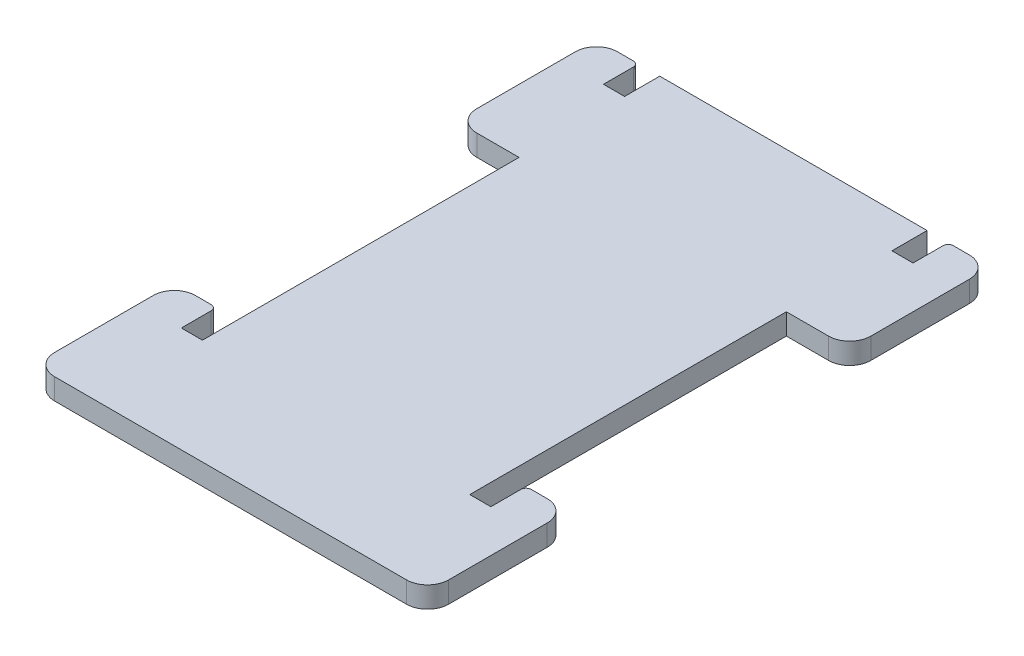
ISO-10303-21;
HEADER;
FILE_DESCRIPTION(('STEP AP214'),'2;1');
FILE_NAME('part.step','',(''),(''),'','','');
FILE_SCHEMA(('AUTOMOTIVE_DESIGN { 1 0 10303 214 1 1 1 1 }'));
ENDSEC;
DATA;
#1=APPLICATION_CONTEXT('core data for automotive mechanical design processes');
#2=APPLICATION_PROTOCOL_DEFINITION('international standard','automotive_design',2000,#1);
#3=PRODUCT_CONTEXT('',#1,'mechanical');
#4=PRODUCT('Part','Part','',(#3));
#5=PRODUCT_RELATED_PRODUCT_CATEGORY('part','',(#4));
#6=PRODUCT_DEFINITION_FORMATION('','',#4);
#7=PRODUCT_DEFINITION_CONTEXT('part definition',#1,'design');
#8=PRODUCT_DEFINITION('design','',#6,#7);
#9=PRODUCT_DEFINITION_SHAPE('','',#8);
#10=(LENGTH_UNIT() NAMED_UNIT(*) SI_UNIT(.MILLI.,.METRE.));
#11=(NAMED_UNIT(*) PLANE_ANGLE_UNIT() SI_UNIT($,.RADIAN.));
#12=(NAMED_UNIT(*) SI_UNIT($,.STERADIAN.) SOLID_ANGLE_UNIT());
#13=UNCERTAINTY_MEASURE_WITH_UNIT(LENGTH_MEASURE(1.E-05),#10,'distance_accuracy_value','');
#14=(GEOMETRIC_REPRESENTATION_CONTEXT(3) GLOBAL_UNCERTAINTY_ASSIGNED_CONTEXT((#13)) GLOBAL_UNIT_ASSIGNED_CONTEXT((#10,
#11,#12)) REPRESENTATION_CONTEXT('',''));
#15=CARTESIAN_POINT('',(0.,0.,0.));
#16=DIRECTION('',(0.,0.,1.));
#17=DIRECTION('',(1.,0.,0.));
#18=AXIS2_PLACEMENT_3D('',#15,#16,#17);
#19=CARTESIAN_POINT('',(47.,3.,0.));
#20=DIRECTION('',(-1.,0.,0.));
#21=DIRECTION('',(0.,0.,1.));
#22=AXIS2_PLACEMENT_3D('',#19,#20,#21);
#23=PLANE('',#22);
#24=DIRECTION('',(0.,0.,-1.));
#25=VECTOR('',#24,1.);
#26=CARTESIAN_POINT('',(47.,3.,0.));
#27=LINE('',#26,#25);
#28=CARTESIAN_POINT('',(47.,3.,-3.));
#29=VERTEX_POINT('',#28);
#30=CARTESIAN_POINT('',(47.,3.,-17.));
#31=VERTEX_POINT('',#30);
#32=EDGE_CURVE('E769',#29,#31,#27,.T.);
#33=ORIENTED_EDGE('',*,*,#32,.F.);
#34=DIRECTION('',(0.,-1.,0.));
#35=VECTOR('',#34,1.);
#36=CARTESIAN_POINT('',(47.,3.,-3.));
#37=LINE('',#36,#35);
#38=CARTESIAN_POINT('',(47.,0.,-3.));
#39=VERTEX_POINT('',#38);
#40=EDGE_CURVE('E636',#29,#39,#37,.T.);
#41=ORIENTED_EDGE('',*,*,#40,.T.);
#42=DIRECTION('',(0.,0.,-1.));
#43=VECTOR('',#42,1.);
#44=CARTESIAN_POINT('',(47.,0.,0.));
#45=LINE('',#44,#43);
#46=CARTESIAN_POINT('',(47.,0.,-17.));
#47=VERTEX_POINT('',#46);
#48=EDGE_CURVE('E366',#39,#47,#45,.T.);
#49=ORIENTED_EDGE('',*,*,#48,.T.);
#50=DIRECTION('',(0.,-1.,0.));
#51=VECTOR('',#50,1.);
#52=CARTESIAN_POINT('',(47.,3.,-17.));
#53=LINE('',#52,#51);
#54=EDGE_CURVE('E506',#47,#31,#53,.F.);
#55=ORIENTED_EDGE('',*,*,#54,.T.);
#56=EDGE_LOOP('',(#33,#41,#49,#55));
#57=FACE_BOUND('',#56,.T.);
#58=ADVANCED_FACE('F38',(#57),#23,.F.);
#59=CARTESIAN_POINT('',(41.,3.,-20.));
#60=DIRECTION('',(0.,0.,1.));
#61=DIRECTION('',(1.,0.,0.));
#62=AXIS2_PLACEMENT_3D('',#59,#60,#61);
#63=PLANE('',#62);
#64=DIRECTION('',(-1.,0.,0.));
#65=VECTOR('',#64,1.);
#66=CARTESIAN_POINT('',(41.,0.,-20.));
#67=LINE('',#66,#65);
#68=CARTESIAN_POINT('',(44.,0.,-20.));
#69=VERTEX_POINT('',#68);
#70=CARTESIAN_POINT('',(41.75,0.,-20.));
#71=VERTEX_POINT('',#70);
#72=EDGE_CURVE('E369',#69,#71,#67,.T.);
#73=ORIENTED_EDGE('',*,*,#72,.T.);
#74=DIRECTION('',(0.,-1.,0.));
#75=VECTOR('',#74,1.);
#76=CARTESIAN_POINT('',(41.75,3.,-20.));
#77=LINE('',#76,#75);
#78=CARTESIAN_POINT('',(41.75,3.,-20.));
#79=VERTEX_POINT('',#78);
#80=EDGE_CURVE('E593',#71,#79,#77,.F.);
#81=ORIENTED_EDGE('',*,*,#80,.T.);
#82=DIRECTION('',(-1.,0.,0.));
#83=VECTOR('',#82,1.);
#84=CARTESIAN_POINT('',(41.,3.,-20.));
#85=LINE('',#84,#83);
#86=CARTESIAN_POINT('',(44.,3.,-20.));
#87=VERTEX_POINT('',#86);
#88=EDGE_CURVE('E284',#87,#79,#85,.T.);
#89=ORIENTED_EDGE('',*,*,#88,.F.);
#90=DIRECTION('',(0.,-1.,0.));
#91=VECTOR('',#90,1.);
#92=CARTESIAN_POINT('',(44.,3.,-20.));
#93=LINE('',#92,#91);
#94=EDGE_CURVE('E294',#87,#69,#93,.T.);
#95=ORIENTED_EDGE('',*,*,#94,.T.);
#96=EDGE_LOOP('',(#73,#81,#89,#95));
#97=FACE_BOUND('',#96,.T.);
#98=ADVANCED_FACE('F793',(#97),#63,.F.);
#99=CARTESIAN_POINT('',(41.,3.,-15.));
#100=DIRECTION('',(1.,0.,0.));
#101=DIRECTION('',(0.,0.,-1.));
#102=AXIS2_PLACEMENT_3D('',#99,#100,#101);
#103=PLANE('',#102);
#104=DIRECTION('',(0.,0.,1.));
#105=VECTOR('',#104,1.);
#106=CARTESIAN_POINT('',(41.,3.,-15.));
#107=LINE('',#106,#105);
#108=CARTESIAN_POINT('',(41.,3.,-19.25));
#109=VERTEX_POINT('',#108);
#110=CARTESIAN_POINT('',(41.,3.,-15.));
#111=VERTEX_POINT('',#110);
#112=EDGE_CURVE('E270',#109,#111,#107,.T.);
#113=ORIENTED_EDGE('',*,*,#112,.F.);
#114=DIRECTION('',(0.,-1.,0.));
#115=VECTOR('',#114,1.);
#116=CARTESIAN_POINT('',(41.,3.,-19.25));
#117=LINE('',#116,#115);
#118=CARTESIAN_POINT('',(41.,0.,-19.25));
#119=VERTEX_POINT('',#118);
#120=EDGE_CURVE('E590',#109,#119,#117,.T.);
#121=ORIENTED_EDGE('',*,*,#120,.T.);
#122=DIRECTION('',(0.,0.,1.));
#123=VECTOR('',#122,1.);
#124=CARTESIAN_POINT('',(41.,0.,-15.));
#125=LINE('',#124,#123);
#126=CARTESIAN_POINT('',(41.,0.,-15.));
#127=VERTEX_POINT('',#126);
#128=EDGE_CURVE('E290',#119,#127,#125,.T.);
#129=ORIENTED_EDGE('',*,*,#128,.T.);
#130=DIRECTION('',(0.,-1.,0.));
#131=VECTOR('',#130,1.);
#132=CARTESIAN_POINT('',(41.,3.,-15.));
#133=LINE('',#132,#131);
#134=EDGE_CURVE('E287',#111,#127,#133,.T.);
#135=ORIENTED_EDGE('',*,*,#134,.F.);
#136=EDGE_LOOP('',(#113,#121,#129,#135));
#137=FACE_BOUND('',#136,.T.);
#138=ADVANCED_FACE('F288',(#137),#103,.F.);
#139=CARTESIAN_POINT('',(38.,3.,-15.));
#140=DIRECTION('',(0.,0.,1.));
#141=DIRECTION('',(1.,0.,0.));
#142=AXIS2_PLACEMENT_3D('',#139,#140,#141);
#143=PLANE('',#142);
#144=DIRECTION('',(-1.,0.,0.));
#145=VECTOR('',#144,1.);
#146=CARTESIAN_POINT('',(38.,0.,-15.));
#147=LINE('',#146,#145);
#148=CARTESIAN_POINT('',(38.,0.,-15.));
#149=VERTEX_POINT('',#148);
#150=EDGE_CURVE('E375',#127,#149,#147,.T.);
#151=ORIENTED_EDGE('',*,*,#150,.T.);
#152=DIRECTION('',(0.,-1.,0.));
#153=VECTOR('',#152,1.);
#154=CARTESIAN_POINT('',(38.,3.,-15.));
#155=LINE('',#154,#153);
#156=CARTESIAN_POINT('',(38.,3.,-15.));
#157=VERTEX_POINT('',#156);
#158=EDGE_CURVE('E295',#157,#149,#155,.T.);
#159=ORIENTED_EDGE('',*,*,#158,.F.);
#160=DIRECTION('',(-1.,0.,0.));
#161=VECTOR('',#160,1.);
#162=CARTESIAN_POINT('',(38.,3.,-15.));
#163=LINE('',#162,#161);
#164=EDGE_CURVE('E275',#111,#157,#163,.T.);
#165=ORIENTED_EDGE('',*,*,#164,.F.);
#166=ORIENTED_EDGE('',*,*,#134,.T.);
#167=EDGE_LOOP('',(#151,#159,#165,#166));
#168=FACE_BOUND('',#167,.T.);
#169=ADVANCED_FACE('F297',(#168),#143,.F.);
#170=CARTESIAN_POINT('',(38.,3.,-15.));
#171=DIRECTION('',(-1.,0.,0.));
#172=DIRECTION('',(0.,0.,1.));
#173=AXIS2_PLACEMENT_3D('',#170,#171,#172);
#174=PLANE('',#173);
#175=DIRECTION('',(0.,0.,-1.));
#176=VECTOR('',#175,1.);
#177=CARTESIAN_POINT('',(38.,0.,-15.));
#178=LINE('',#177,#176);
#179=CARTESIAN_POINT('',(38.,0.,-60.));
#180=VERTEX_POINT('',#179);
#181=EDGE_CURVE('E378',#149,#180,#178,.T.);
#182=ORIENTED_EDGE('',*,*,#181,.T.);
#183=DIRECTION('',(0.,-1.,0.));
#184=VECTOR('',#183,1.);
#185=CARTESIAN_POINT('',(38.,3.,-60.));
#186=LINE('',#185,#184);
#187=CARTESIAN_POINT('',(38.,3.,-60.));
#188=VERTEX_POINT('',#187);
#189=EDGE_CURVE('E481',#188,#180,#186,.T.);
#190=ORIENTED_EDGE('',*,*,#189,.F.);
#191=DIRECTION('',(0.,0.,-1.));
#192=VECTOR('',#191,1.);
#193=CARTESIAN_POINT('',(38.,3.,-15.));
#194=LINE('',#193,#192);
#195=EDGE_CURVE('E301',#157,#188,#194,.T.);
#196=ORIENTED_EDGE('',*,*,#195,.F.);
#197=ORIENTED_EDGE('',*,*,#158,.T.);
#198=EDGE_LOOP('',(#182,#190,#196,#197));
#199=FACE_BOUND('',#198,.T.);
#200=ADVANCED_FACE('F784',(#199),#174,.F.);
#201=CARTESIAN_POINT('',(41.,3.,-60.));
#202=DIRECTION('',(0.,0.,-1.));
#203=DIRECTION('',(-1.,0.,0.));
#204=AXIS2_PLACEMENT_3D('',#201,#202,#203);
#205=PLANE('',#204);
#206=DIRECTION('',(1.,0.,0.));
#207=VECTOR('',#206,1.);
#208=CARTESIAN_POINT('',(41.,0.,-60.));
#209=LINE('',#208,#207);
#210=CARTESIAN_POINT('',(44.,0.,-60.));
#211=VERTEX_POINT('',#210);
#212=EDGE_CURVE('E382',#180,#211,#209,.T.);
#213=ORIENTED_EDGE('',*,*,#212,.T.);
#214=DIRECTION('',(0.,-1.,0.));
#215=VECTOR('',#214,1.);
#216=CARTESIAN_POINT('',(44.,3.,-60.));
#217=LINE('',#216,#215);
#218=CARTESIAN_POINT('',(44.,3.,-60.));
#219=VERTEX_POINT('',#218);
#220=EDGE_CURVE('E11',#211,#219,#217,.F.);
#221=ORIENTED_EDGE('',*,*,#220,.T.);
#222=DIRECTION('',(1.,0.,0.));
#223=VECTOR('',#222,1.);
#224=CARTESIAN_POINT('',(38.,3.,-60.));
#225=LINE('',#224,#223);
#226=EDGE_CURVE('E304',#188,#219,#225,.T.);
#227=ORIENTED_EDGE('',*,*,#226,.F.);
#228=ORIENTED_EDGE('',*,*,#189,.T.);
#229=EDGE_LOOP('',(#213,#221,#227,#228));
#230=FACE_BOUND('',#229,.T.);
#231=ADVANCED_FACE('F1036',(#230),#205,.F.);
#232=CARTESIAN_POINT('',(47.,3.,-60.));
#233=DIRECTION('',(-1.,0.,0.));
#234=DIRECTION('',(0.,0.,1.));
#235=AXIS2_PLACEMENT_3D('',#232,#233,#234);
#236=PLANE('',#235);
#237=DIRECTION('',(0.,0.,-1.));
#238=VECTOR('',#237,1.);
#239=CARTESIAN_POINT('',(47.,3.,-60.));
#240=LINE('',#239,#238);
#241=CARTESIAN_POINT('',(47.,3.,-63.));
#242=VERTEX_POINT('',#241);
#243=CARTESIAN_POINT('',(47.,3.,-77.));
#244=VERTEX_POINT('',#243);
#245=EDGE_CURVE('E310',#242,#244,#240,.T.);
#246=ORIENTED_EDGE('',*,*,#245,.F.);
#247=DIRECTION('',(0.,-1.,0.));
#248=VECTOR('',#247,1.);
#249=CARTESIAN_POINT('',(47.,3.,-63.));
#250=LINE('',#249,#248);
#251=CARTESIAN_POINT('',(47.,0.,-63.));
#252=VERTEX_POINT('',#251);
#253=EDGE_CURVE('E47',#242,#252,#250,.T.);
#254=ORIENTED_EDGE('',*,*,#253,.T.);
#255=DIRECTION('',(0.,0.,-1.));
#256=VECTOR('',#255,1.);
#257=CARTESIAN_POINT('',(47.,0.,-60.));
#258=LINE('',#257,#256);
#259=CARTESIAN_POINT('',(47.,0.,-77.));
#260=VERTEX_POINT('',#259);
#261=EDGE_CURVE('E385',#252,#260,#258,.T.);
#262=ORIENTED_EDGE('',*,*,#261,.T.);
#263=DIRECTION('',(0.,-1.,0.));
#264=VECTOR('',#263,1.);
#265=CARTESIAN_POINT('',(47.,3.,-77.));
#266=LINE('',#265,#264);
#267=EDGE_CURVE('E526',#260,#244,#266,.F.);
#268=ORIENTED_EDGE('',*,*,#267,.T.);
#269=EDGE_LOOP('',(#246,#254,#262,#268));
#270=FACE_BOUND('',#269,.T.);
#271=ADVANCED_FACE('F644',(#270),#236,.F.);
#272=CARTESIAN_POINT('',(41.,3.,-80.));
#273=DIRECTION('',(0.,0.,1.));
#274=DIRECTION('',(1.,0.,0.));
#275=AXIS2_PLACEMENT_3D('',#272,#273,#274);
#276=PLANE('',#275);
#277=DIRECTION('',(-1.,0.,0.));
#278=VECTOR('',#277,1.);
#279=CARTESIAN_POINT('',(41.,0.,-80.));
#280=LINE('',#279,#278);
#281=CARTESIAN_POINT('',(44.,0.,-80.));
#282=VERTEX_POINT('',#281);
#283=CARTESIAN_POINT('',(41.75,0.,-80.));
#284=VERTEX_POINT('',#283);
#285=EDGE_CURVE('E388',#282,#284,#280,.T.);
#286=ORIENTED_EDGE('',*,*,#285,.T.);
#287=DIRECTION('',(0.,-1.,0.));
#288=VECTOR('',#287,1.);
#289=CARTESIAN_POINT('',(41.75,3.,-80.));
#290=LINE('',#289,#288);
#291=CARTESIAN_POINT('',(41.75,3.,-80.));
#292=VERTEX_POINT('',#291);
#293=EDGE_CURVE('E587',#284,#292,#290,.F.);
#294=ORIENTED_EDGE('',*,*,#293,.T.);
#295=DIRECTION('',(-1.,0.,0.));
#296=VECTOR('',#295,1.);
#297=CARTESIAN_POINT('',(41.,3.,-80.));
#298=LINE('',#297,#296);
#299=CARTESIAN_POINT('',(44.,3.,-80.));
#300=VERTEX_POINT('',#299);
#301=EDGE_CURVE('E313',#300,#292,#298,.T.);
#302=ORIENTED_EDGE('',*,*,#301,.F.);
#303=DIRECTION('',(0.,-1.,0.));
#304=VECTOR('',#303,1.);
#305=CARTESIAN_POINT('',(44.,3.,-80.));
#306=LINE('',#305,#304);
#307=EDGE_CURVE('E522',#300,#282,#306,.T.);
#308=ORIENTED_EDGE('',*,*,#307,.T.);
#309=EDGE_LOOP('',(#286,#294,#302,#308));
#310=FACE_BOUND('',#309,.T.);
#311=ADVANCED_FACE('F658',(#310),#276,.F.);
#312=CARTESIAN_POINT('',(41.,3.,-75.));
#313=DIRECTION('',(1.,0.,0.));
#314=DIRECTION('',(0.,0.,-1.));
#315=AXIS2_PLACEMENT_3D('',#312,#313,#314);
#316=PLANE('',#315);
#317=DIRECTION('',(0.,0.,1.));
#318=VECTOR('',#317,1.);
#319=CARTESIAN_POINT('',(41.,3.,-75.));
#320=LINE('',#319,#318);
#321=CARTESIAN_POINT('',(41.,3.,-79.25));
#322=VERTEX_POINT('',#321);
#323=CARTESIAN_POINT('',(41.,3.,-75.));
#324=VERTEX_POINT('',#323);
#325=EDGE_CURVE('E317',#322,#324,#320,.T.);
#326=ORIENTED_EDGE('',*,*,#325,.F.);
#327=DIRECTION('',(0.,-1.,0.));
#328=VECTOR('',#327,1.);
#329=CARTESIAN_POINT('',(41.,3.,-79.25));
#330=LINE('',#329,#328);
#331=CARTESIAN_POINT('',(41.,0.,-79.25));
#332=VERTEX_POINT('',#331);
#333=EDGE_CURVE('E583',#322,#332,#330,.T.);
#334=ORIENTED_EDGE('',*,*,#333,.T.);
#335=DIRECTION('',(0.,0.,1.));
#336=VECTOR('',#335,1.);
#337=CARTESIAN_POINT('',(41.,0.,-75.));
#338=LINE('',#337,#336);
#339=CARTESIAN_POINT('',(41.,0.,-75.));
#340=VERTEX_POINT('',#339);
#341=EDGE_CURVE('E392',#332,#340,#338,.T.);
#342=ORIENTED_EDGE('',*,*,#341,.T.);
#343=DIRECTION('',(0.,-1.,0.));
#344=VECTOR('',#343,1.);
#345=CARTESIAN_POINT('',(41.,3.,-75.));
#346=LINE('',#345,#344);
#347=EDGE_CURVE('E477',#324,#340,#346,.T.);
#348=ORIENTED_EDGE('',*,*,#347,.F.);
#349=EDGE_LOOP('',(#326,#334,#342,#348));
#350=FACE_BOUND('',#349,.T.);
#351=ADVANCED_FACE('F666',(#350),#316,.F.);
#352=CARTESIAN_POINT('',(38.,3.,-75.));
#353=DIRECTION('',(0.,0.,1.));
#354=DIRECTION('',(1.,0.,0.));
#355=AXIS2_PLACEMENT_3D('',#352,#353,#354);
#356=PLANE('',#355);
#357=DIRECTION('',(-1.,0.,0.));
#358=VECTOR('',#357,1.);
#359=CARTESIAN_POINT('',(38.,0.,-75.));
#360=LINE('',#359,#358);
#361=CARTESIAN_POINT('',(38.,0.,-75.));
#362=VERTEX_POINT('',#361);
#363=EDGE_CURVE('E395',#340,#362,#360,.T.);
#364=ORIENTED_EDGE('',*,*,#363,.T.);
#365=DIRECTION('',(0.,-1.,0.));
#366=VECTOR('',#365,1.);
#367=CARTESIAN_POINT('',(38.,3.,-75.));
#368=LINE('',#367,#366);
#369=CARTESIAN_POINT('',(38.,3.,-75.));
#370=VERTEX_POINT('',#369);
#371=EDGE_CURVE('E473',#370,#362,#368,.T.);
#372=ORIENTED_EDGE('',*,*,#371,.F.);
#373=DIRECTION('',(-1.,0.,0.));
#374=VECTOR('',#373,1.);
#375=CARTESIAN_POINT('',(38.,3.,-75.));
#376=LINE('',#375,#374);
#377=EDGE_CURVE('E320',#324,#370,#376,.T.);
#378=ORIENTED_EDGE('',*,*,#377,.F.);
#379=ORIENTED_EDGE('',*,*,#347,.T.);
#380=EDGE_LOOP('',(#364,#372,#378,#379));
#381=FACE_BOUND('',#380,.T.);
#382=ADVANCED_FACE('F672',(#381),#356,.F.);
#383=CARTESIAN_POINT('',(38.,3.,-75.));
#384=DIRECTION('',(-1.,0.,0.));
#385=DIRECTION('',(0.,0.,1.));
#386=AXIS2_PLACEMENT_3D('',#383,#384,#385);
#387=PLANE('',#386);
#388=DIRECTION('',(0.,0.,-1.));
#389=VECTOR('',#388,1.);
#390=CARTESIAN_POINT('',(38.,0.,-75.));
#391=LINE('',#390,#389);
#392=CARTESIAN_POINT('',(38.,0.,-80.));
#393=VERTEX_POINT('',#392);
#394=EDGE_CURVE('E398',#362,#393,#391,.T.);
#395=ORIENTED_EDGE('',*,*,#394,.T.);
#396=DIRECTION('',(0.,-1.,0.));
#397=VECTOR('',#396,1.);
#398=CARTESIAN_POINT('',(38.,3.,-80.));
#399=LINE('',#398,#397);
#400=CARTESIAN_POINT('',(38.,3.,-80.));
#401=VERTEX_POINT('',#400);
#402=EDGE_CURVE('E469',#401,#393,#399,.T.);
#403=ORIENTED_EDGE('',*,*,#402,.F.);
#404=DIRECTION('',(0.,0.,-1.));
#405=VECTOR('',#404,1.);
#406=CARTESIAN_POINT('',(38.,3.,-75.));
#407=LINE('',#406,#405);
#408=EDGE_CURVE('E323',#370,#401,#407,.T.);
#409=ORIENTED_EDGE('',*,*,#408,.F.);
#410=ORIENTED_EDGE('',*,*,#371,.T.);
#411=EDGE_LOOP('',(#395,#403,#409,#410));
#412=FACE_BOUND('',#411,.T.);
#413=ADVANCED_FACE('F678',(#412),#387,.F.);
#414=CARTESIAN_POINT('',(0.,3.,-80.));
#415=DIRECTION('',(0.,0.,1.));
#416=DIRECTION('',(1.,0.,0.));
#417=AXIS2_PLACEMENT_3D('',#414,#415,#416);
#418=PLANE('',#417);
#419=DIRECTION('',(-1.,0.,0.));
#420=VECTOR('',#419,1.);
#421=CARTESIAN_POINT('',(0.,0.,-80.));
#422=LINE('',#421,#420);
#423=CARTESIAN_POINT('',(0.,0.,-80.));
#424=VERTEX_POINT('',#423);
#425=EDGE_CURVE('E401',#393,#424,#422,.T.);
#426=ORIENTED_EDGE('',*,*,#425,.T.);
#427=DIRECTION('',(0.,-1.,0.));
#428=VECTOR('',#427,1.);
#429=CARTESIAN_POINT('',(0.,3.,-80.));
#430=LINE('',#429,#428);
#431=CARTESIAN_POINT('',(0.,3.,-80.));
#432=VERTEX_POINT('',#431);
#433=EDGE_CURVE('E465',#432,#424,#430,.T.);
#434=ORIENTED_EDGE('',*,*,#433,.F.);
#435=DIRECTION('',(-1.,0.,0.));
#436=VECTOR('',#435,1.);
#437=CARTESIAN_POINT('',(0.,3.,-80.));
#438=LINE('',#437,#436);
#439=EDGE_CURVE('E326',#401,#432,#438,.T.);
#440=ORIENTED_EDGE('',*,*,#439,.F.);
#441=ORIENTED_EDGE('',*,*,#402,.T.);
#442=EDGE_LOOP('',(#426,#434,#440,#441));
#443=FACE_BOUND('',#442,.T.);
#444=ADVANCED_FACE('F682',(#443),#418,.F.);
#445=CARTESIAN_POINT('',(0.,3.,-75.));
#446=DIRECTION('',(1.,0.,0.));
#447=DIRECTION('',(0.,0.,-1.));
#448=AXIS2_PLACEMENT_3D('',#445,#446,#447);
#449=PLANE('',#448);
#450=DIRECTION('',(0.,0.,1.));
#451=VECTOR('',#450,1.);
#452=CARTESIAN_POINT('',(0.,0.,-75.));
#453=LINE('',#452,#451);
#454=CARTESIAN_POINT('',(0.,0.,-75.));
#455=VERTEX_POINT('',#454);
#456=EDGE_CURVE('E404',#424,#455,#453,.T.);
#457=ORIENTED_EDGE('',*,*,#456,.T.);
#458=DIRECTION('',(0.,-1.,0.));
#459=VECTOR('',#458,1.);
#460=CARTESIAN_POINT('',(0.,3.,-75.));
#461=LINE('',#460,#459);
#462=CARTESIAN_POINT('',(0.,3.,-75.));
#463=VERTEX_POINT('',#462);
#464=EDGE_CURVE('E461',#463,#455,#461,.T.);
#465=ORIENTED_EDGE('',*,*,#464,.F.);
#466=DIRECTION('',(0.,0.,1.));
#467=VECTOR('',#466,1.);
#468=CARTESIAN_POINT('',(0.,3.,-75.));
#469=LINE('',#468,#467);
#470=EDGE_CURVE('E329',#432,#463,#469,.T.);
#471=ORIENTED_EDGE('',*,*,#470,.F.);
#472=ORIENTED_EDGE('',*,*,#433,.T.);
#473=EDGE_LOOP('',(#457,#465,#471,#472));
#474=FACE_BOUND('',#473,.T.);
#475=ADVANCED_FACE('F687',(#474),#449,.F.);
#476=CARTESIAN_POINT('',(0.,3.,-75.));
#477=DIRECTION('',(0.,0.,1.));
#478=DIRECTION('',(1.,0.,0.));
#479=AXIS2_PLACEMENT_3D('',#476,#477,#478);
#480=PLANE('',#479);
#481=DIRECTION('',(-1.,0.,0.));
#482=VECTOR('',#481,1.);
#483=CARTESIAN_POINT('',(0.,0.,-75.));
#484=LINE('',#483,#482);
#485=CARTESIAN_POINT('',(-3.00000000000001,0.,-75.));
#486=VERTEX_POINT('',#485);
#487=EDGE_CURVE('E407',#455,#486,#484,.T.);
#488=ORIENTED_EDGE('',*,*,#487,.T.);
#489=DIRECTION('',(0.,-1.,0.));
#490=VECTOR('',#489,1.);
#491=CARTESIAN_POINT('',(-3.00000000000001,3.,-75.));
#492=LINE('',#491,#490);
#493=CARTESIAN_POINT('',(-3.00000000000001,3.,-75.));
#494=VERTEX_POINT('',#493);
#495=EDGE_CURVE('E457',#494,#486,#492,.T.);
#496=ORIENTED_EDGE('',*,*,#495,.F.);
#497=DIRECTION('',(-1.,0.,0.));
#498=VECTOR('',#497,1.);
#499=CARTESIAN_POINT('',(0.,3.,-75.));
#500=LINE('',#499,#498);
#501=EDGE_CURVE('E332',#463,#494,#500,.T.);
#502=ORIENTED_EDGE('',*,*,#501,.F.);
#503=ORIENTED_EDGE('',*,*,#464,.T.);
#504=EDGE_LOOP('',(#488,#496,#502,#503));
#505=FACE_BOUND('',#504,.T.);
#506=ADVANCED_FACE('F693',(#505),#480,.F.);
#507=CARTESIAN_POINT('',(-3.00000000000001,3.,-75.));
#508=DIRECTION('',(-1.,0.,0.));
#509=DIRECTION('',(0.,0.,1.));
#510=AXIS2_PLACEMENT_3D('',#507,#508,#509);
#511=PLANE('',#510);
#512=DIRECTION('',(0.,0.,-1.));
#513=VECTOR('',#512,1.);
#514=CARTESIAN_POINT('',(-3.00000000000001,0.,-75.));
#515=LINE('',#514,#513);
#516=CARTESIAN_POINT('',(-3.00000000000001,0.,-79.25));
#517=VERTEX_POINT('',#516);
#518=EDGE_CURVE('E410',#486,#517,#515,.T.);
#519=ORIENTED_EDGE('',*,*,#518,.T.);
#520=DIRECTION('',(0.,-1.,0.));
#521=VECTOR('',#520,1.);
#522=CARTESIAN_POINT('',(-3.00000000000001,3.,-79.25));
#523=LINE('',#522,#521);
#524=CARTESIAN_POINT('',(-3.00000000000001,3.,-79.25));
#525=VERTEX_POINT('',#524);
#526=EDGE_CURVE('E562',#517,#525,#523,.F.);
#527=ORIENTED_EDGE('',*,*,#526,.T.);
#528=DIRECTION('',(0.,0.,-1.));
#529=VECTOR('',#528,1.);
#530=CARTESIAN_POINT('',(-3.00000000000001,3.,-75.));
#531=LINE('',#530,#529);
#532=EDGE_CURVE('E335',#494,#525,#531,.T.);
#533=ORIENTED_EDGE('',*,*,#532,.F.);
#534=ORIENTED_EDGE('',*,*,#495,.T.);
#535=EDGE_LOOP('',(#519,#527,#533,#534));
#536=FACE_BOUND('',#535,.T.);
#537=ADVANCED_FACE('F697',(#536),#511,.F.);
#538=CARTESIAN_POINT('',(-3.00000000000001,3.,-80.));
#539=DIRECTION('',(0.,0.,1.));
#540=DIRECTION('',(1.,0.,0.));
#541=AXIS2_PLACEMENT_3D('',#538,#539,#540);
#542=PLANE('',#541);
#543=DIRECTION('',(-1.,0.,0.));
#544=VECTOR('',#543,1.);
#545=CARTESIAN_POINT('',(-3.00000000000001,3.,-80.));
#546=LINE('',#545,#544);
#547=CARTESIAN_POINT('',(-3.75000000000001,3.,-80.));
#548=VERTEX_POINT('',#547);
#549=CARTESIAN_POINT('',(-6.00000000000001,3.,-80.));
#550=VERTEX_POINT('',#549);
#551=EDGE_CURVE('E339',#548,#550,#546,.T.);
#552=ORIENTED_EDGE('',*,*,#551,.F.);
#553=DIRECTION('',(0.,-1.,0.));
#554=VECTOR('',#553,1.);
#555=CARTESIAN_POINT('',(-3.75000000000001,3.,-80.));
#556=LINE('',#555,#554);
#557=CARTESIAN_POINT('',(-3.75000000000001,0.,-80.));
#558=VERTEX_POINT('',#557);
#559=EDGE_CURVE('E546',#548,#558,#556,.T.);
#560=ORIENTED_EDGE('',*,*,#559,.T.);
#561=DIRECTION('',(-1.,0.,0.));
#562=VECTOR('',#561,1.);
#563=CARTESIAN_POINT('',(-3.00000000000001,0.,-80.));
#564=LINE('',#563,#562);
#565=CARTESIAN_POINT('',(-6.00000000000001,0.,-80.));
#566=VERTEX_POINT('',#565);
#567=EDGE_CURVE('E414',#558,#566,#564,.T.);
#568=ORIENTED_EDGE('',*,*,#567,.T.);
#569=DIRECTION('',(0.,-1.,0.));
#570=VECTOR('',#569,1.);
#571=CARTESIAN_POINT('',(-6.00000000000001,3.,-80.));
#572=LINE('',#571,#570);
#573=EDGE_CURVE('E534',#566,#550,#572,.F.);
#574=ORIENTED_EDGE('',*,*,#573,.T.);
#575=EDGE_LOOP('',(#552,#560,#568,#574));
#576=FACE_BOUND('',#575,.T.);
#577=ADVANCED_FACE('F704',(#576),#542,.F.);
#578=CARTESIAN_POINT('',(-9.,3.,-60.));
#579=DIRECTION('',(1.,0.,0.));
#580=DIRECTION('',(0.,0.,-1.));
#581=AXIS2_PLACEMENT_3D('',#578,#579,#580);
#582=PLANE('',#581);
#583=DIRECTION('',(0.,0.,1.));
#584=VECTOR('',#583,1.);
#585=CARTESIAN_POINT('',(-9.,0.,-60.));
#586=LINE('',#585,#584);
#587=CARTESIAN_POINT('',(-9.00000000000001,0.,-77.));
#588=VERTEX_POINT('',#587);
#589=CARTESIAN_POINT('',(-9.,0.,-63.));
#590=VERTEX_POINT('',#589);
#591=EDGE_CURVE('E417',#588,#590,#586,.T.);
#592=ORIENTED_EDGE('',*,*,#591,.T.);
#593=DIRECTION('',(0.,-1.,0.));
#594=VECTOR('',#593,1.);
#595=CARTESIAN_POINT('',(-9.,3.,-63.));
#596=LINE('',#595,#594);
#597=CARTESIAN_POINT('',(-9.,3.,-63.));
#598=VERTEX_POINT('',#597);
#599=EDGE_CURVE('E612',#590,#598,#596,.F.);
#600=ORIENTED_EDGE('',*,*,#599,.T.);
#601=DIRECTION('',(0.,0.,1.));
#602=VECTOR('',#601,1.);
#603=CARTESIAN_POINT('',(-9.,3.,-60.));
#604=LINE('',#603,#602);
#605=CARTESIAN_POINT('',(-9.00000000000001,3.,-77.));
#606=VERTEX_POINT('',#605);
#607=EDGE_CURVE('E342',#606,#598,#604,.T.);
#608=ORIENTED_EDGE('',*,*,#607,.F.);
#609=DIRECTION('',(0.,-1.,0.));
#610=VECTOR('',#609,1.);
#611=CARTESIAN_POINT('',(-9.00000000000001,3.,-77.));
#612=LINE('',#611,#610);
#613=EDGE_CURVE('E530',#606,#588,#612,.T.);
#614=ORIENTED_EDGE('',*,*,#613,.T.);
#615=EDGE_LOOP('',(#592,#600,#608,#614));
#616=FACE_BOUND('',#615,.T.);
#617=ADVANCED_FACE('F714',(#616),#582,.F.);
#618=CARTESIAN_POINT('',(0.,3.,-60.));
#619=DIRECTION('',(0.,0.,-1.));
#620=DIRECTION('',(-1.,0.,0.));
#621=AXIS2_PLACEMENT_3D('',#618,#619,#620);
#622=PLANE('',#621);
#623=DIRECTION('',(1.,0.,0.));
#624=VECTOR('',#623,1.);
#625=CARTESIAN_POINT('',(-3.,3.,-60.));
#626=LINE('',#625,#624);
#627=CARTESIAN_POINT('',(-5.99999999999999,3.,-60.));
#628=VERTEX_POINT('',#627);
#629=CARTESIAN_POINT('',(0.,3.,-60.));
#630=VERTEX_POINT('',#629);
#631=EDGE_CURVE('E345',#628,#630,#626,.T.);
#632=ORIENTED_EDGE('',*,*,#631,.F.);
#633=DIRECTION('',(0.,-1.,0.));
#634=VECTOR('',#633,1.);
#635=CARTESIAN_POINT('',(-5.99999999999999,3.,-60.));
#636=LINE('',#635,#634);
#637=CARTESIAN_POINT('',(-5.99999999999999,0.,-60.));
#638=VERTEX_POINT('',#637);
#639=EDGE_CURVE('E596',#628,#638,#636,.T.);
#640=ORIENTED_EDGE('',*,*,#639,.T.);
#641=DIRECTION('',(1.,0.,0.));
#642=VECTOR('',#641,1.);
#643=CARTESIAN_POINT('',(0.,0.,-60.));
#644=LINE('',#643,#642);
#645=CARTESIAN_POINT('',(0.,0.,-60.));
#646=VERTEX_POINT('',#645);
#647=EDGE_CURVE('E421',#638,#646,#644,.T.);
#648=ORIENTED_EDGE('',*,*,#647,.T.);
#649=DIRECTION('',(0.,-1.,0.));
#650=VECTOR('',#649,1.);
#651=CARTESIAN_POINT('',(0.,3.,-60.));
#652=LINE('',#651,#650);
#653=EDGE_CURVE('E453',#630,#646,#652,.T.);
#654=ORIENTED_EDGE('',*,*,#653,.F.);
#655=EDGE_LOOP('',(#632,#640,#648,#654));
#656=FACE_BOUND('',#655,.T.);
#657=ADVANCED_FACE('F723',(#656),#622,.F.);
#658=CARTESIAN_POINT('',(0.,3.,-15.));
#659=DIRECTION('',(1.,0.,0.));
#660=DIRECTION('',(0.,0.,-1.));
#661=AXIS2_PLACEMENT_3D('',#658,#659,#660);
#662=PLANE('',#661);
#663=DIRECTION('',(0.,0.,1.));
#664=VECTOR('',#663,1.);
#665=CARTESIAN_POINT('',(0.,0.,-15.));
#666=LINE('',#665,#664);
#667=CARTESIAN_POINT('',(0.,0.,-15.));
#668=VERTEX_POINT('',#667);
#669=EDGE_CURVE('E424',#646,#668,#666,.T.);
#670=ORIENTED_EDGE('',*,*,#669,.T.);
#671=DIRECTION('',(0.,-1.,0.));
#672=VECTOR('',#671,1.);
#673=CARTESIAN_POINT('',(0.,3.,-15.));
#674=LINE('',#673,#672);
#675=CARTESIAN_POINT('',(0.,3.,-15.));
#676=VERTEX_POINT('',#675);
#677=EDGE_CURVE('E449',#676,#668,#674,.T.);
#678=ORIENTED_EDGE('',*,*,#677,.F.);
#679=DIRECTION('',(0.,0.,1.));
#680=VECTOR('',#679,1.);
#681=CARTESIAN_POINT('',(0.,3.,-15.));
#682=LINE('',#681,#680);
#683=EDGE_CURVE('E348',#630,#676,#682,.T.);
#684=ORIENTED_EDGE('',*,*,#683,.F.);
#685=ORIENTED_EDGE('',*,*,#653,.T.);
#686=EDGE_LOOP('',(#670,#678,#684,#685));
#687=FACE_BOUND('',#686,.T.);
#688=ADVANCED_FACE('F728',(#687),#662,.F.);
#689=CARTESIAN_POINT('',(0.,3.,-15.));
#690=DIRECTION('',(0.,0.,1.));
#691=DIRECTION('',(1.,0.,0.));
#692=AXIS2_PLACEMENT_3D('',#689,#690,#691);
#693=PLANE('',#692);
#694=DIRECTION('',(-1.,0.,0.));
#695=VECTOR('',#694,1.);
#696=CARTESIAN_POINT('',(0.,0.,-15.));
#697=LINE('',#696,#695);
#698=CARTESIAN_POINT('',(-2.99999999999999,0.,-15.));
#699=VERTEX_POINT('',#698);
#700=EDGE_CURVE('E427',#668,#699,#697,.T.);
#701=ORIENTED_EDGE('',*,*,#700,.T.);
#702=DIRECTION('',(0.,-1.,0.));
#703=VECTOR('',#702,1.);
#704=CARTESIAN_POINT('',(-2.99999999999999,3.,-15.));
#705=LINE('',#704,#703);
#706=CARTESIAN_POINT('',(-2.99999999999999,3.,-15.));
#707=VERTEX_POINT('',#706);
#708=EDGE_CURVE('E365',#707,#699,#705,.T.);
#709=ORIENTED_EDGE('',*,*,#708,.F.);
#710=DIRECTION('',(-1.,0.,0.));
#711=VECTOR('',#710,1.);
#712=CARTESIAN_POINT('',(0.,3.,-15.));
#713=LINE('',#712,#711);
#714=EDGE_CURVE('E351',#676,#707,#713,.T.);
#715=ORIENTED_EDGE('',*,*,#714,.F.);
#716=ORIENTED_EDGE('',*,*,#677,.T.);
#717=EDGE_LOOP('',(#701,#709,#715,#716));
#718=FACE_BOUND('',#717,.T.);
#719=ADVANCED_FACE('F734',(#718),#693,.F.);
#720=CARTESIAN_POINT('',(-2.99999999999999,3.,-15.));
#721=DIRECTION('',(-1.,0.,0.));
#722=DIRECTION('',(0.,0.,1.));
#723=AXIS2_PLACEMENT_3D('',#720,#721,#722);
#724=PLANE('',#723);
#725=DIRECTION('',(0.,0.,-1.));
#726=VECTOR('',#725,1.);
#727=CARTESIAN_POINT('',(-2.99999999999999,0.,-15.));
#728=LINE('',#727,#726);
#729=CARTESIAN_POINT('',(-2.99999999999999,0.,-19.25));
#730=VERTEX_POINT('',#729);
#731=EDGE_CURVE('E430',#699,#730,#728,.T.);
#732=ORIENTED_EDGE('',*,*,#731,.T.);
#733=DIRECTION('',(0.,-1.,0.));
#734=VECTOR('',#733,1.);
#735=CARTESIAN_POINT('',(-2.99999999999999,3.,-19.25));
#736=LINE('',#735,#734);
#737=CARTESIAN_POINT('',(-2.99999999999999,3.,-19.25));
#738=VERTEX_POINT('',#737);
#739=EDGE_CURVE('E580',#730,#738,#736,.F.);
#740=ORIENTED_EDGE('',*,*,#739,.T.);
#741=DIRECTION('',(0.,0.,-1.));
#742=VECTOR('',#741,1.);
#743=CARTESIAN_POINT('',(-2.99999999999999,3.,-15.));
#744=LINE('',#743,#742);
#745=EDGE_CURVE('E354',#707,#738,#744,.T.);
#746=ORIENTED_EDGE('',*,*,#745,.F.);
#747=ORIENTED_EDGE('',*,*,#708,.T.);
#748=EDGE_LOOP('',(#732,#740,#746,#747));
#749=FACE_BOUND('',#748,.T.);
#750=ADVANCED_FACE('F738',(#749),#724,.F.);
#751=CARTESIAN_POINT('',(-3.,3.,-20.));
#752=DIRECTION('',(0.,0.,1.));
#753=DIRECTION('',(1.,0.,0.));
#754=AXIS2_PLACEMENT_3D('',#751,#752,#753);
#755=PLANE('',#754);
#756=DIRECTION('',(-1.,0.,0.));
#757=VECTOR('',#756,1.);
#758=CARTESIAN_POINT('',(-3.,3.,-20.));
#759=LINE('',#758,#757);
#760=CARTESIAN_POINT('',(-3.74999999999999,3.,-20.));
#761=VERTEX_POINT('',#760);
#762=CARTESIAN_POINT('',(-5.99999999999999,3.,-20.));
#763=VERTEX_POINT('',#762);
#764=EDGE_CURVE('E358',#761,#763,#759,.T.);
#765=ORIENTED_EDGE('',*,*,#764,.F.);
#766=DIRECTION('',(0.,-1.,0.));
#767=VECTOR('',#766,1.);
#768=CARTESIAN_POINT('',(-3.74999999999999,3.,-20.));
#769=LINE('',#768,#767);
#770=CARTESIAN_POINT('',(-3.74999999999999,0.,-20.));
#771=VERTEX_POINT('',#770);
#772=EDGE_CURVE('E576',#761,#771,#769,.T.);
#773=ORIENTED_EDGE('',*,*,#772,.T.);
#774=DIRECTION('',(-1.,0.,0.));
#775=VECTOR('',#774,1.);
#776=CARTESIAN_POINT('',(-3.,0.,-20.));
#777=LINE('',#776,#775);
#778=CARTESIAN_POINT('',(-5.99999999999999,0.,-20.));
#779=VERTEX_POINT('',#778);
#780=EDGE_CURVE('E434',#771,#779,#777,.T.);
#781=ORIENTED_EDGE('',*,*,#780,.T.);
#782=DIRECTION('',(0.,-1.,0.));
#783=VECTOR('',#782,1.);
#784=CARTESIAN_POINT('',(-5.99999999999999,3.,-20.));
#785=LINE('',#784,#783);
#786=EDGE_CURVE('E542',#779,#763,#785,.F.);
#787=ORIENTED_EDGE('',*,*,#786,.T.);
#788=EDGE_LOOP('',(#765,#773,#781,#787));
#789=FACE_BOUND('',#788,.T.);
#790=ADVANCED_FACE('F745',(#789),#755,.F.);
#791=CARTESIAN_POINT('',(-8.99999999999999,3.,0.));
#792=DIRECTION('',(1.,0.,0.));
#793=DIRECTION('',(0.,0.,-1.));
#794=AXIS2_PLACEMENT_3D('',#791,#792,#793);
#795=PLANE('',#794);
#796=DIRECTION('',(0.,0.,1.));
#797=VECTOR('',#796,1.);
#798=CARTESIAN_POINT('',(-8.99999999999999,0.,0.));
#799=LINE('',#798,#797);
#800=CARTESIAN_POINT('',(-8.99999999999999,0.,-17.));
#801=VERTEX_POINT('',#800);
#802=CARTESIAN_POINT('',(-8.99999999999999,0.,-3.));
#803=VERTEX_POINT('',#802);
#804=EDGE_CURVE('E437',#801,#803,#799,.T.);
#805=ORIENTED_EDGE('',*,*,#804,.T.);
#806=DIRECTION('',(0.,-1.,0.));
#807=VECTOR('',#806,1.);
#808=CARTESIAN_POINT('',(-8.99999999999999,3.,-3.));
#809=LINE('',#808,#807);
#810=CARTESIAN_POINT('',(-8.99999999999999,3.,-3.));
#811=VERTEX_POINT('',#810);
#812=EDGE_CURVE('E633',#803,#811,#809,.F.);
#813=ORIENTED_EDGE('',*,*,#812,.T.);
#814=DIRECTION('',(0.,0.,1.));
#815=VECTOR('',#814,1.);
#816=CARTESIAN_POINT('',(-8.99999999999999,3.,0.));
#817=LINE('',#816,#815);
#818=CARTESIAN_POINT('',(-8.99999999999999,3.,-17.));
#819=VERTEX_POINT('',#818);
#820=EDGE_CURVE('E361',#819,#811,#817,.T.);
#821=ORIENTED_EDGE('',*,*,#820,.F.);
#822=DIRECTION('',(0.,-1.,0.));
#823=VECTOR('',#822,1.);
#824=CARTESIAN_POINT('',(-8.99999999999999,3.,-17.));
#825=LINE('',#824,#823);
#826=EDGE_CURVE('E538',#819,#801,#825,.T.);
#827=ORIENTED_EDGE('',*,*,#826,.T.);
#828=EDGE_LOOP('',(#805,#813,#821,#827));
#829=FACE_BOUND('',#828,.T.);
#830=ADVANCED_FACE('F755',(#829),#795,.F.);
#831=CARTESIAN_POINT('',(-3.,3.,0.));
#832=DIRECTION('',(0.,0.,-1.));
#833=DIRECTION('',(-1.,0.,0.));
#834=AXIS2_PLACEMENT_3D('',#831,#832,#833);
#835=PLANE('',#834);
#836=DIRECTION('',(1.,0.,0.));
#837=VECTOR('',#836,1.);
#838=CARTESIAN_POINT('',(0.,3.,0.));
#839=LINE('',#838,#837);
#840=CARTESIAN_POINT('',(-5.99999999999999,3.,0.));
#841=VERTEX_POINT('',#840);
#842=CARTESIAN_POINT('',(44.,3.,0.));
#843=VERTEX_POINT('',#842);
#844=EDGE_CURVE('E445',#841,#843,#839,.T.);
#845=ORIENTED_EDGE('',*,*,#844,.F.);
#846=DIRECTION('',(0.,-1.,0.));
#847=VECTOR('',#846,1.);
#848=CARTESIAN_POINT('',(-5.99999999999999,3.,0.));
#849=LINE('',#848,#847);
#850=CARTESIAN_POINT('',(-5.99999999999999,0.,0.));
#851=VERTEX_POINT('',#850);
#852=EDGE_CURVE('E629',#841,#851,#849,.T.);
#853=ORIENTED_EDGE('',*,*,#852,.T.);
#854=DIRECTION('',(1.,0.,0.));
#855=VECTOR('',#854,1.);
#856=CARTESIAN_POINT('',(-3.,0.,0.));
#857=LINE('',#856,#855);
#858=CARTESIAN_POINT('',(44.,0.,0.));
#859=VERTEX_POINT('',#858);
#860=EDGE_CURVE('E441',#851,#859,#857,.T.);
#861=ORIENTED_EDGE('',*,*,#860,.T.);
#862=DIRECTION('',(0.,-1.,0.));
#863=VECTOR('',#862,1.);
#864=CARTESIAN_POINT('',(44.,3.,0.));
#865=LINE('',#864,#863);
#866=EDGE_CURVE('E626',#859,#843,#865,.F.);
#867=ORIENTED_EDGE('',*,*,#866,.T.);
#868=EDGE_LOOP('',(#845,#853,#861,#867));
#869=FACE_BOUND('',#868,.T.);
#870=ADVANCED_FACE('F765',(#869),#835,.F.);
#871=CARTESIAN_POINT('',(0.,3.,0.));
#872=DIRECTION('',(0.,-1.,0.));
#873=DIRECTION('',(0.,0.,-1.));
#874=AXIS2_PLACEMENT_3D('',#871,#872,#873);
#875=PLANE('',#874);
#876=ORIENTED_EDGE('',*,*,#607,.T.);
#877=CARTESIAN_POINT('',(-6.,3.,-63.));
#878=DIRECTION('',(0.,-1.,0.));
#879=DIRECTION('',(0.,0.,-1.));
#880=AXIS2_PLACEMENT_3D('',#877,#878,#879);
#881=CIRCLE('',#880,3.);
#882=EDGE_CURVE('E623',#598,#628,#881,.F.);
#883=ORIENTED_EDGE('',*,*,#882,.T.);
#884=ORIENTED_EDGE('',*,*,#631,.T.);
#885=ORIENTED_EDGE('',*,*,#683,.T.);
#886=ORIENTED_EDGE('',*,*,#714,.T.);
#887=ORIENTED_EDGE('',*,*,#745,.T.);
#888=CARTESIAN_POINT('',(-3.74999999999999,3.,-19.25));
#889=DIRECTION('',(0.,-1.,0.));
#890=DIRECTION('',(0.,0.,-1.));
#891=AXIS2_PLACEMENT_3D('',#888,#889,#890);
#892=CIRCLE('',#891,0.75);
#893=EDGE_CURVE('E570',#738,#761,#892,.F.);
#894=ORIENTED_EDGE('',*,*,#893,.T.);
#895=ORIENTED_EDGE('',*,*,#764,.T.);
#896=CARTESIAN_POINT('',(-5.99999999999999,3.,-17.));
#897=DIRECTION('',(0.,-1.,0.));
#898=DIRECTION('',(0.,0.,-1.));
#899=AXIS2_PLACEMENT_3D('',#896,#897,#898);
#900=CIRCLE('',#899,3.);
#901=EDGE_CURVE('E510',#763,#819,#900,.F.);
#902=ORIENTED_EDGE('',*,*,#901,.T.);
#903=ORIENTED_EDGE('',*,*,#820,.T.);
#904=CARTESIAN_POINT('',(-5.99999999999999,3.,-3.));
#905=DIRECTION('',(0.,-1.,0.));
#906=DIRECTION('',(0.,0.,-1.));
#907=AXIS2_PLACEMENT_3D('',#904,#905,#906);
#908=CIRCLE('',#907,3.);
#909=EDGE_CURVE('E620',#811,#841,#908,.F.);
#910=ORIENTED_EDGE('',*,*,#909,.T.);
#911=ORIENTED_EDGE('',*,*,#844,.T.);
#912=CARTESIAN_POINT('',(44.,3.,-3.));
#913=DIRECTION('',(0.,-1.,0.));
#914=DIRECTION('',(0.,0.,-1.));
#915=AXIS2_PLACEMENT_3D('',#912,#913,#914);
#916=CIRCLE('',#915,3.);
#917=EDGE_CURVE('E617',#843,#29,#916,.F.);
#918=ORIENTED_EDGE('',*,*,#917,.T.);
#919=ORIENTED_EDGE('',*,*,#32,.T.);
#920=CARTESIAN_POINT('',(44.,3.,-17.));
#921=DIRECTION('',(0.,-1.,0.));
#922=DIRECTION('',(0.,0.,-1.));
#923=AXIS2_PLACEMENT_3D('',#920,#921,#922);
#924=CIRCLE('',#923,3.);
#925=EDGE_CURVE('E519',#31,#87,#924,.F.);
#926=ORIENTED_EDGE('',*,*,#925,.T.);
#927=ORIENTED_EDGE('',*,*,#88,.T.);
#928=CARTESIAN_POINT('',(41.75,3.,-19.25));
#929=DIRECTION('',(0.,-1.,0.));
#930=DIRECTION('',(0.,0.,-1.));
#931=AXIS2_PLACEMENT_3D('',#928,#929,#930);
#932=CIRCLE('',#931,0.75);
#933=EDGE_CURVE('E279',#79,#109,#932,.F.);
#934=ORIENTED_EDGE('',*,*,#933,.T.);
#935=ORIENTED_EDGE('',*,*,#112,.T.);
#936=ORIENTED_EDGE('',*,*,#164,.T.);
#937=ORIENTED_EDGE('',*,*,#195,.T.);
#938=ORIENTED_EDGE('',*,*,#226,.T.);
#939=CARTESIAN_POINT('',(44.,3.,-63.));
#940=DIRECTION('',(0.,-1.,0.));
#941=DIRECTION('',(0.,0.,-1.));
#942=AXIS2_PLACEMENT_3D('',#939,#940,#941);
#943=CIRCLE('',#942,3.);
#944=EDGE_CURVE('E54',#219,#242,#943,.F.);
#945=ORIENTED_EDGE('',*,*,#944,.T.);
#946=ORIENTED_EDGE('',*,*,#245,.T.);
#947=CARTESIAN_POINT('',(44.,3.,-77.));
#948=DIRECTION('',(0.,-1.,0.));
#949=DIRECTION('',(0.,0.,-1.));
#950=AXIS2_PLACEMENT_3D('',#947,#948,#949);
#951=CIRCLE('',#950,3.);
#952=EDGE_CURVE('E516',#244,#300,#951,.F.);
#953=ORIENTED_EDGE('',*,*,#952,.T.);
#954=ORIENTED_EDGE('',*,*,#301,.T.);
#955=CARTESIAN_POINT('',(41.75,3.,-79.25));
#956=DIRECTION('',(0.,-1.,0.));
#957=DIRECTION('',(0.,0.,-1.));
#958=AXIS2_PLACEMENT_3D('',#955,#956,#957);
#959=CIRCLE('',#958,0.75);
#960=EDGE_CURVE('E567',#292,#322,#959,.F.);
#961=ORIENTED_EDGE('',*,*,#960,.T.);
#962=ORIENTED_EDGE('',*,*,#325,.T.);
#963=ORIENTED_EDGE('',*,*,#377,.T.);
#964=ORIENTED_EDGE('',*,*,#408,.T.);
#965=ORIENTED_EDGE('',*,*,#439,.T.);
#966=ORIENTED_EDGE('',*,*,#470,.T.);
#967=ORIENTED_EDGE('',*,*,#501,.T.);
#968=ORIENTED_EDGE('',*,*,#532,.T.);
#969=CARTESIAN_POINT('',(-3.75000000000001,3.,-79.25));
#970=DIRECTION('',(0.,-1.,0.));
#971=DIRECTION('',(0.,0.,-1.));
#972=AXIS2_PLACEMENT_3D('',#969,#970,#971);
#973=CIRCLE('',#972,0.75);
#974=EDGE_CURVE('E573',#525,#548,#973,.F.);
#975=ORIENTED_EDGE('',*,*,#974,.T.);
#976=ORIENTED_EDGE('',*,*,#551,.T.);
#977=CARTESIAN_POINT('',(-6.00000000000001,3.,-77.));
#978=DIRECTION('',(0.,-1.,0.));
#979=DIRECTION('',(0.,0.,-1.));
#980=AXIS2_PLACEMENT_3D('',#977,#978,#979);
#981=CIRCLE('',#980,3.);
#982=EDGE_CURVE('E513',#550,#606,#981,.F.);
#983=ORIENTED_EDGE('',*,*,#982,.T.);
#984=EDGE_LOOP('',(#876,#883,#884,#885,#886,#887,#894,#895,#902,#903,#910,#911,#918,#919,#926,
#927,#934,#935,#936,#937,#938,#945,#946,#953,#954,#961,#962,#963,#964,#965,#966,#967,#968,#975,
#976,#983));
#985=FACE_BOUND('',#984,.T.);
#986=ADVANCED_FACE('F273',(#985),#875,.F.);
#987=CARTESIAN_POINT('',(0.,0.,0.));
#988=DIRECTION('',(0.,-1.,0.));
#989=DIRECTION('',(0.,0.,-1.));
#990=AXIS2_PLACEMENT_3D('',#987,#988,#989);
#991=PLANE('',#990);
#992=ORIENTED_EDGE('',*,*,#647,.F.);
#993=CARTESIAN_POINT('',(-6.,0.,-63.));
#994=DIRECTION('',(0.,-1.,0.));
#995=DIRECTION('',(0.,0.,-1.));
#996=AXIS2_PLACEMENT_3D('',#993,#994,#995);
#997=CIRCLE('',#996,3.);
#998=EDGE_CURVE('E609',#638,#590,#997,.T.);
#999=ORIENTED_EDGE('',*,*,#998,.T.);
#1000=ORIENTED_EDGE('',*,*,#591,.F.);
#1001=CARTESIAN_POINT('',(-6.00000000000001,0.,-77.));
#1002=DIRECTION('',(0.,-1.,0.));
#1003=DIRECTION('',(0.,0.,-1.));
#1004=AXIS2_PLACEMENT_3D('',#1001,#1002,#1003);
#1005=CIRCLE('',#1004,3.);
#1006=EDGE_CURVE('E494',#588,#566,#1005,.T.);
#1007=ORIENTED_EDGE('',*,*,#1006,.T.);
#1008=ORIENTED_EDGE('',*,*,#567,.F.);
#1009=CARTESIAN_POINT('',(-3.75000000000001,0.,-79.25));
#1010=DIRECTION('',(0.,-1.,0.));
#1011=DIRECTION('',(0.,0.,-1.));
#1012=AXIS2_PLACEMENT_3D('',#1009,#1010,#1011);
#1013=CIRCLE('',#1012,0.75);
#1014=EDGE_CURVE('E559',#558,#517,#1013,.T.);
#1015=ORIENTED_EDGE('',*,*,#1014,.T.);
#1016=ORIENTED_EDGE('',*,*,#518,.F.);
#1017=ORIENTED_EDGE('',*,*,#487,.F.);
#1018=ORIENTED_EDGE('',*,*,#456,.F.);
#1019=ORIENTED_EDGE('',*,*,#425,.F.);
#1020=ORIENTED_EDGE('',*,*,#394,.F.);
#1021=ORIENTED_EDGE('',*,*,#363,.F.);
#1022=ORIENTED_EDGE('',*,*,#341,.F.);
#1023=CARTESIAN_POINT('',(41.75,0.,-79.25));
#1024=DIRECTION('',(0.,-1.,0.));
#1025=DIRECTION('',(0.,0.,-1.));
#1026=AXIS2_PLACEMENT_3D('',#1023,#1024,#1025);
#1027=CIRCLE('',#1026,0.75);
#1028=EDGE_CURVE('E553',#332,#284,#1027,.T.);
#1029=ORIENTED_EDGE('',*,*,#1028,.T.);
#1030=ORIENTED_EDGE('',*,*,#285,.F.);
#1031=CARTESIAN_POINT('',(44.,0.,-77.));
#1032=DIRECTION('',(0.,-1.,0.));
#1033=DIRECTION('',(0.,0.,-1.));
#1034=AXIS2_PLACEMENT_3D('',#1031,#1032,#1033);
#1035=CIRCLE('',#1034,3.);
#1036=EDGE_CURVE('E498',#282,#260,#1035,.T.);
#1037=ORIENTED_EDGE('',*,*,#1036,.T.);
#1038=ORIENTED_EDGE('',*,*,#261,.F.);
#1039=CARTESIAN_POINT('',(44.,0.,-63.));
#1040=DIRECTION('',(0.,-1.,0.));
#1041=DIRECTION('',(0.,0.,-1.));
#1042=AXIS2_PLACEMENT_3D('',#1039,#1040,#1041);
#1043=CIRCLE('',#1042,3.);
#1044=EDGE_CURVE('E600',#252,#211,#1043,.T.);
#1045=ORIENTED_EDGE('',*,*,#1044,.T.);
#1046=ORIENTED_EDGE('',*,*,#212,.F.);
#1047=ORIENTED_EDGE('',*,*,#181,.F.);
#1048=ORIENTED_EDGE('',*,*,#150,.F.);
#1049=ORIENTED_EDGE('',*,*,#128,.F.);
#1050=CARTESIAN_POINT('',(41.75,0.,-19.25));
#1051=DIRECTION('',(0.,-1.,0.));
#1052=DIRECTION('',(0.,0.,-1.));
#1053=AXIS2_PLACEMENT_3D('',#1050,#1051,#1052);
#1054=CIRCLE('',#1053,0.75);
#1055=EDGE_CURVE('E550',#119,#71,#1054,.T.);
#1056=ORIENTED_EDGE('',*,*,#1055,.T.);
#1057=ORIENTED_EDGE('',*,*,#72,.F.);
#1058=CARTESIAN_POINT('',(44.,0.,-17.));
#1059=DIRECTION('',(0.,-1.,0.));
#1060=DIRECTION('',(0.,0.,-1.));
#1061=AXIS2_PLACEMENT_3D('',#1058,#1059,#1060);
#1062=CIRCLE('',#1061,3.);
#1063=EDGE_CURVE('E502',#69,#47,#1062,.T.);
#1064=ORIENTED_EDGE('',*,*,#1063,.T.);
#1065=ORIENTED_EDGE('',*,*,#48,.F.);
#1066=CARTESIAN_POINT('',(44.,0.,-3.));
#1067=DIRECTION('',(0.,-1.,0.));
#1068=DIRECTION('',(0.,0.,-1.));
#1069=AXIS2_PLACEMENT_3D('',#1066,#1067,#1068);
#1070=CIRCLE('',#1069,3.);
#1071=EDGE_CURVE('E603',#39,#859,#1070,.T.);
#1072=ORIENTED_EDGE('',*,*,#1071,.T.);
#1073=ORIENTED_EDGE('',*,*,#860,.F.);
#1074=CARTESIAN_POINT('',(-5.99999999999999,0.,-3.));
#1075=DIRECTION('',(0.,-1.,0.));
#1076=DIRECTION('',(0.,0.,-1.));
#1077=AXIS2_PLACEMENT_3D('',#1074,#1075,#1076);
#1078=CIRCLE('',#1077,3.);
#1079=EDGE_CURVE('E606',#851,#803,#1078,.T.);
#1080=ORIENTED_EDGE('',*,*,#1079,.T.);
#1081=ORIENTED_EDGE('',*,*,#804,.F.);
#1082=CARTESIAN_POINT('',(-5.99999999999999,0.,-17.));
#1083=DIRECTION('',(0.,-1.,0.));
#1084=DIRECTION('',(0.,0.,-1.));
#1085=AXIS2_PLACEMENT_3D('',#1082,#1083,#1084);
#1086=CIRCLE('',#1085,3.);
#1087=EDGE_CURVE('E490',#801,#779,#1086,.T.);
#1088=ORIENTED_EDGE('',*,*,#1087,.T.);
#1089=ORIENTED_EDGE('',*,*,#780,.F.);
#1090=CARTESIAN_POINT('',(-3.74999999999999,0.,-19.25));
#1091=DIRECTION('',(0.,-1.,0.));
#1092=DIRECTION('',(0.,0.,-1.));
#1093=AXIS2_PLACEMENT_3D('',#1090,#1091,#1092);
#1094=CIRCLE('',#1093,0.75);
#1095=EDGE_CURVE('E556',#771,#730,#1094,.T.);
#1096=ORIENTED_EDGE('',*,*,#1095,.T.);
#1097=ORIENTED_EDGE('',*,*,#731,.F.);
#1098=ORIENTED_EDGE('',*,*,#700,.F.);
#1099=ORIENTED_EDGE('',*,*,#669,.F.);
#1100=EDGE_LOOP('',(#992,#999,#1000,#1007,#1008,#1015,#1016,#1017,#1018,#1019,#1020,#1021,#1022,
#1029,#1030,#1037,#1038,#1045,#1046,#1047,#1048,#1049,#1056,#1057,#1064,#1065,#1072,#1073,#1080,
#1081,#1088,#1089,#1096,#1097,#1098,#1099));
#1101=FACE_BOUND('',#1100,.T.);
#1102=ADVANCED_FACE('F648',(#1101),#991,.T.);
#1103=CARTESIAN_POINT('',(44.,3.,-17.));
#1104=DIRECTION('',(0.,-1.,0.));
#1105=DIRECTION('',(0.,0.,-1.));
#1106=AXIS2_PLACEMENT_3D('',#1103,#1104,#1105);
#1107=CYLINDRICAL_SURFACE('',#1106,3.);
#1108=ORIENTED_EDGE('',*,*,#925,.F.);
#1109=ORIENTED_EDGE('',*,*,#54,.F.);
#1110=ORIENTED_EDGE('',*,*,#1063,.F.);
#1111=ORIENTED_EDGE('',*,*,#94,.F.);
#1112=EDGE_LOOP('',(#1108,#1109,#1110,#1111));
#1113=FACE_BOUND('',#1112,.T.);
#1114=ADVANCED_FACE('F805',(#1113),#1107,.T.);
#1115=CARTESIAN_POINT('',(44.,3.,-77.));
#1116=DIRECTION('',(0.,-1.,0.));
#1117=DIRECTION('',(0.,0.,-1.));
#1118=AXIS2_PLACEMENT_3D('',#1115,#1116,#1117);
#1119=CYLINDRICAL_SURFACE('',#1118,3.);
#1120=ORIENTED_EDGE('',*,*,#952,.F.);
#1121=ORIENTED_EDGE('',*,*,#267,.F.);
#1122=ORIENTED_EDGE('',*,*,#1036,.F.);
#1123=ORIENTED_EDGE('',*,*,#307,.F.);
#1124=EDGE_LOOP('',(#1120,#1121,#1122,#1123));
#1125=FACE_BOUND('',#1124,.T.);
#1126=ADVANCED_FACE('F654',(#1125),#1119,.T.);
#1127=CARTESIAN_POINT('',(-6.00000000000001,3.,-77.));
#1128=DIRECTION('',(0.,-1.,0.));
#1129=DIRECTION('',(0.,0.,-1.));
#1130=AXIS2_PLACEMENT_3D('',#1127,#1128,#1129);
#1131=CYLINDRICAL_SURFACE('',#1130,3.);
#1132=ORIENTED_EDGE('',*,*,#982,.F.);
#1133=ORIENTED_EDGE('',*,*,#573,.F.);
#1134=ORIENTED_EDGE('',*,*,#1006,.F.);
#1135=ORIENTED_EDGE('',*,*,#613,.F.);
#1136=EDGE_LOOP('',(#1132,#1133,#1134,#1135));
#1137=FACE_BOUND('',#1136,.T.);
#1138=ADVANCED_FACE('F710',(#1137),#1131,.T.);
#1139=CARTESIAN_POINT('',(-5.99999999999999,3.,-17.));
#1140=DIRECTION('',(0.,-1.,0.));
#1141=DIRECTION('',(0.,0.,-1.));
#1142=AXIS2_PLACEMENT_3D('',#1139,#1140,#1141);
#1143=CYLINDRICAL_SURFACE('',#1142,3.);
#1144=ORIENTED_EDGE('',*,*,#901,.F.);
#1145=ORIENTED_EDGE('',*,*,#786,.F.);
#1146=ORIENTED_EDGE('',*,*,#1087,.F.);
#1147=ORIENTED_EDGE('',*,*,#826,.F.);
#1148=EDGE_LOOP('',(#1144,#1145,#1146,#1147));
#1149=FACE_BOUND('',#1148,.T.);
#1150=ADVANCED_FACE('F751',(#1149),#1143,.T.);
#1151=CARTESIAN_POINT('',(-3.75000000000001,3.,-79.25));
#1152=DIRECTION('',(0.,-1.,0.));
#1153=DIRECTION('',(0.,0.,-1.));
#1154=AXIS2_PLACEMENT_3D('',#1151,#1152,#1153);
#1155=CYLINDRICAL_SURFACE('',#1154,0.75);
#1156=ORIENTED_EDGE('',*,*,#974,.F.);
#1157=ORIENTED_EDGE('',*,*,#526,.F.);
#1158=ORIENTED_EDGE('',*,*,#1014,.F.);
#1159=ORIENTED_EDGE('',*,*,#559,.F.);
#1160=EDGE_LOOP('',(#1156,#1157,#1158,#1159));
#1161=FACE_BOUND('',#1160,.T.);
#1162=ADVANCED_FACE('F700',(#1161),#1155,.T.);
#1163=CARTESIAN_POINT('',(-3.74999999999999,3.,-19.25));
#1164=DIRECTION('',(0.,-1.,0.));
#1165=DIRECTION('',(0.,0.,-1.));
#1166=AXIS2_PLACEMENT_3D('',#1163,#1164,#1165);
#1167=CYLINDRICAL_SURFACE('',#1166,0.75);
#1168=ORIENTED_EDGE('',*,*,#893,.F.);
#1169=ORIENTED_EDGE('',*,*,#739,.F.);
#1170=ORIENTED_EDGE('',*,*,#1095,.F.);
#1171=ORIENTED_EDGE('',*,*,#772,.F.);
#1172=EDGE_LOOP('',(#1168,#1169,#1170,#1171));
#1173=FACE_BOUND('',#1172,.T.);
#1174=ADVANCED_FACE('F741',(#1173),#1167,.T.);
#1175=CARTESIAN_POINT('',(41.75,3.,-79.25));
#1176=DIRECTION('',(0.,-1.,0.));
#1177=DIRECTION('',(0.,0.,-1.));
#1178=AXIS2_PLACEMENT_3D('',#1175,#1176,#1177);
#1179=CYLINDRICAL_SURFACE('',#1178,0.75);
#1180=ORIENTED_EDGE('',*,*,#960,.F.);
#1181=ORIENTED_EDGE('',*,*,#293,.F.);
#1182=ORIENTED_EDGE('',*,*,#1028,.F.);
#1183=ORIENTED_EDGE('',*,*,#333,.F.);
#1184=EDGE_LOOP('',(#1180,#1181,#1182,#1183));
#1185=FACE_BOUND('',#1184,.T.);
#1186=ADVANCED_FACE('F661',(#1185),#1179,.T.);
#1187=CARTESIAN_POINT('',(41.75,3.,-19.25));
#1188=DIRECTION('',(0.,-1.,0.));
#1189=DIRECTION('',(0.,0.,-1.));
#1190=AXIS2_PLACEMENT_3D('',#1187,#1188,#1189);
#1191=CYLINDRICAL_SURFACE('',#1190,0.75);
#1192=ORIENTED_EDGE('',*,*,#933,.F.);
#1193=ORIENTED_EDGE('',*,*,#80,.F.);
#1194=ORIENTED_EDGE('',*,*,#1055,.F.);
#1195=ORIENTED_EDGE('',*,*,#120,.F.);
#1196=EDGE_LOOP('',(#1192,#1193,#1194,#1195));
#1197=FACE_BOUND('',#1196,.T.);
#1198=ADVANCED_FACE('F780',(#1197),#1191,.T.);
#1199=CARTESIAN_POINT('',(-6.,3.,-63.));
#1200=DIRECTION('',(0.,-1.,0.));
#1201=DIRECTION('',(0.,0.,-1.));
#1202=AXIS2_PLACEMENT_3D('',#1199,#1200,#1201);
#1203=CYLINDRICAL_SURFACE('',#1202,3.);
#1204=ORIENTED_EDGE('',*,*,#882,.F.);
#1205=ORIENTED_EDGE('',*,*,#599,.F.);
#1206=ORIENTED_EDGE('',*,*,#998,.F.);
#1207=ORIENTED_EDGE('',*,*,#639,.F.);
#1208=EDGE_LOOP('',(#1204,#1205,#1206,#1207));
#1209=FACE_BOUND('',#1208,.T.);
#1210=ADVANCED_FACE('F718',(#1209),#1203,.T.);
#1211=CARTESIAN_POINT('',(-5.99999999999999,3.,-3.));
#1212=DIRECTION('',(0.,-1.,0.));
#1213=DIRECTION('',(0.,0.,-1.));
#1214=AXIS2_PLACEMENT_3D('',#1211,#1212,#1213);
#1215=CYLINDRICAL_SURFACE('',#1214,3.);
#1216=ORIENTED_EDGE('',*,*,#909,.F.);
#1217=ORIENTED_EDGE('',*,*,#812,.F.);
#1218=ORIENTED_EDGE('',*,*,#1079,.F.);
#1219=ORIENTED_EDGE('',*,*,#852,.F.);
#1220=EDGE_LOOP('',(#1216,#1217,#1218,#1219));
#1221=FACE_BOUND('',#1220,.T.);
#1222=ADVANCED_FACE('F759',(#1221),#1215,.T.);
#1223=CARTESIAN_POINT('',(44.,3.,-3.));
#1224=DIRECTION('',(0.,-1.,0.));
#1225=DIRECTION('',(0.,0.,-1.));
#1226=AXIS2_PLACEMENT_3D('',#1223,#1224,#1225);
#1227=CYLINDRICAL_SURFACE('',#1226,3.);
#1228=ORIENTED_EDGE('',*,*,#917,.F.);
#1229=ORIENTED_EDGE('',*,*,#866,.F.);
#1230=ORIENTED_EDGE('',*,*,#1071,.F.);
#1231=ORIENTED_EDGE('',*,*,#40,.F.);
#1232=EDGE_LOOP('',(#1228,#1229,#1230,#1231));
#1233=FACE_BOUND('',#1232,.T.);
#1234=ADVANCED_FACE('F787',(#1233),#1227,.T.);
#1235=CARTESIAN_POINT('',(44.,3.,-63.));
#1236=DIRECTION('',(0.,-1.,0.));
#1237=DIRECTION('',(0.,0.,-1.));
#1238=AXIS2_PLACEMENT_3D('',#1235,#1236,#1237);
#1239=CYLINDRICAL_SURFACE('',#1238,3.);
#1240=ORIENTED_EDGE('',*,*,#944,.F.);
#1241=ORIENTED_EDGE('',*,*,#220,.F.);
#1242=ORIENTED_EDGE('',*,*,#1044,.F.);
#1243=ORIENTED_EDGE('',*,*,#253,.F.);
#1244=EDGE_LOOP('',(#1240,#1241,#1242,#1243));
#1245=FACE_BOUND('',#1244,.T.);
#1246=ADVANCED_FACE('F40',(#1245),#1239,.T.);
#1247=CLOSED_SHELL('',(#58,#98,#138,#169,#200,#231,#271,#311,#351,#382,#413,#444,#475,#506,#537,
#577,#617,#657,#688,#719,#750,#790,#830,#870,#986,#1102,#1114,#1126,#1138,#1150,#1162,#1174,
#1186,#1198,#1210,#1222,#1234,#1246));
#1248=MANIFOLD_SOLID_BREP('B2',#1247);
#1249=ADVANCED_BREP_SHAPE_REPRESENTATION('',(#18,#1248),#14);
#1250=SHAPE_DEFINITION_REPRESENTATION(#9,#1249);
ENDSEC;
END-ISO-10303-21;
